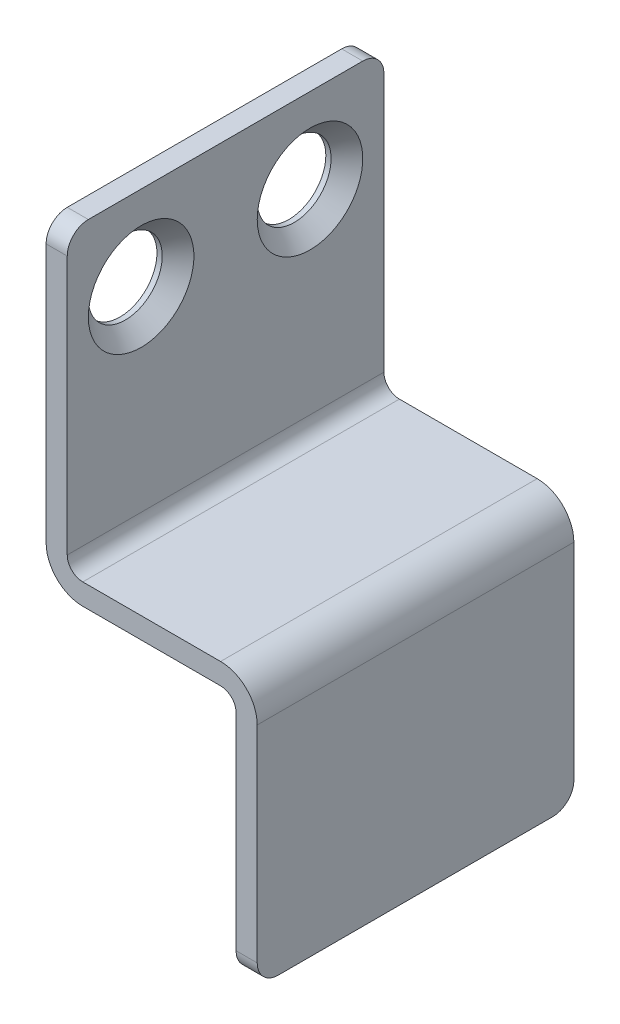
ISO-10303-21;
HEADER;
FILE_DESCRIPTION(('STEP AP214'),'2;1');
FILE_NAME('part.step','',(''),(''),'','','');
FILE_SCHEMA(('AUTOMOTIVE_DESIGN { 1 0 10303 214 1 1 1 1 }'));
ENDSEC;
DATA;
#1=APPLICATION_CONTEXT('core data for automotive mechanical design processes');
#2=APPLICATION_PROTOCOL_DEFINITION('international standard','automotive_design',2000,#1);
#3=PRODUCT_CONTEXT('',#1,'mechanical');
#4=PRODUCT('Part','Part','',(#3));
#5=PRODUCT_RELATED_PRODUCT_CATEGORY('part','',(#4));
#6=PRODUCT_DEFINITION_FORMATION('','',#4);
#7=PRODUCT_DEFINITION_CONTEXT('part definition',#1,'design');
#8=PRODUCT_DEFINITION('design','',#6,#7);
#9=PRODUCT_DEFINITION_SHAPE('','',#8);
#10=(LENGTH_UNIT() NAMED_UNIT(*) SI_UNIT(.MILLI.,.METRE.));
#11=(NAMED_UNIT(*) PLANE_ANGLE_UNIT() SI_UNIT($,.RADIAN.));
#12=(NAMED_UNIT(*) SI_UNIT($,.STERADIAN.) SOLID_ANGLE_UNIT());
#13=UNCERTAINTY_MEASURE_WITH_UNIT(LENGTH_MEASURE(1.E-05),#10,'distance_accuracy_value','');
#14=(GEOMETRIC_REPRESENTATION_CONTEXT(3) GLOBAL_UNCERTAINTY_ASSIGNED_CONTEXT((#13)) GLOBAL_UNIT_ASSIGNED_CONTEXT((#10,
#11,#12)) REPRESENTATION_CONTEXT('',''));
#15=CARTESIAN_POINT('',(0.,0.,0.));
#16=DIRECTION('',(0.,0.,1.));
#17=DIRECTION('',(1.,0.,0.));
#18=AXIS2_PLACEMENT_3D('',#15,#16,#17);
#19=CARTESIAN_POINT('',(32.,34.,146.7));
#20=DIRECTION('',(1.,0.,0.));
#21=DIRECTION('',(0.,0.,1.));
#22=AXIS2_PLACEMENT_3D('',#19,#20,#21);
#23=CONICAL_SURFACE('',#22,2.5,0.785398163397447);
#24=CARTESIAN_POINT('',(32.,34.,146.7));
#25=DIRECTION('',(1.,0.,0.));
#26=DIRECTION('',(0.,0.,1.));
#27=AXIS2_PLACEMENT_3D('',#24,#25,#26);
#28=CIRCLE('',#27,2.5);
#29=CARTESIAN_POINT('',(32.,34.,149.2));
#30=VERTEX_POINT('',#29);
#31=EDGE_CURVE('E11',#30,#30,#28,.T.);
#32=ORIENTED_EDGE('',*,*,#31,.T.);
#33=EDGE_LOOP('',(#32));
#34=FACE_BOUND('',#33,.T.);
#35=CARTESIAN_POINT('',(31.25,34.,146.7));
#36=DIRECTION('',(1.,0.,0.));
#37=DIRECTION('',(0.,0.,1.));
#38=AXIS2_PLACEMENT_3D('',#35,#36,#37);
#39=CIRCLE('',#38,1.75);
#40=CARTESIAN_POINT('',(31.25,34.,148.45));
#41=VERTEX_POINT('',#40);
#42=EDGE_CURVE('E270',#41,#41,#39,.T.);
#43=ORIENTED_EDGE('',*,*,#42,.F.);
#44=EDGE_LOOP('',(#43));
#45=FACE_BOUND('',#44,.T.);
#46=ADVANCED_FACE('F16',(#34,#45),#23,.F.);
#47=CARTESIAN_POINT('',(32.,34.,146.7));
#48=DIRECTION('',(1.,0.,0.));
#49=DIRECTION('',(0.,0.,1.));
#50=AXIS2_PLACEMENT_3D('',#47,#48,#49);
#51=CYLINDRICAL_SURFACE('',#50,1.75);
#52=ORIENTED_EDGE('',*,*,#42,.T.);
#53=EDGE_LOOP('',(#52));
#54=FACE_BOUND('',#53,.T.);
#55=CARTESIAN_POINT('',(31.,34.,146.7));
#56=DIRECTION('',(-1.,0.,0.));
#57=DIRECTION('',(0.,0.,-1.));
#58=AXIS2_PLACEMENT_3D('',#55,#56,#57);
#59=CIRCLE('',#58,1.75);
#60=CARTESIAN_POINT('',(31.,34.,144.95));
#61=VERTEX_POINT('',#60);
#62=EDGE_CURVE('E26',#61,#61,#59,.T.);
#63=ORIENTED_EDGE('',*,*,#62,.T.);
#64=EDGE_LOOP('',(#63));
#65=FACE_BOUND('',#64,.T.);
#66=ADVANCED_FACE('F278',(#54,#65),#51,.F.);
#67=CARTESIAN_POINT('',(32.,34.,154.7));
#68=DIRECTION('',(1.,0.,0.));
#69=DIRECTION('',(0.,0.,1.));
#70=AXIS2_PLACEMENT_3D('',#67,#68,#69);
#71=CONICAL_SURFACE('',#70,2.5,0.785398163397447);
#72=CARTESIAN_POINT('',(32.,34.,154.7));
#73=DIRECTION('',(1.,0.,0.));
#74=DIRECTION('',(0.,0.,1.));
#75=AXIS2_PLACEMENT_3D('',#72,#73,#74);
#76=CIRCLE('',#75,2.5);
#77=CARTESIAN_POINT('',(32.,34.,157.2));
#78=VERTEX_POINT('',#77);
#79=EDGE_CURVE('E267',#78,#78,#76,.T.);
#80=ORIENTED_EDGE('',*,*,#79,.T.);
#81=EDGE_LOOP('',(#80));
#82=FACE_BOUND('',#81,.T.);
#83=CARTESIAN_POINT('',(31.25,34.,154.7));
#84=DIRECTION('',(1.,0.,0.));
#85=DIRECTION('',(0.,0.,1.));
#86=AXIS2_PLACEMENT_3D('',#83,#84,#85);
#87=CIRCLE('',#86,1.75);
#88=CARTESIAN_POINT('',(31.25,34.,156.45));
#89=VERTEX_POINT('',#88);
#90=EDGE_CURVE('E262',#89,#89,#87,.T.);
#91=ORIENTED_EDGE('',*,*,#90,.F.);
#92=EDGE_LOOP('',(#91));
#93=FACE_BOUND('',#92,.T.);
#94=ADVANCED_FACE('F290',(#82,#93),#71,.F.);
#95=CARTESIAN_POINT('',(32.,34.,154.7));
#96=DIRECTION('',(1.,0.,0.));
#97=DIRECTION('',(0.,0.,1.));
#98=AXIS2_PLACEMENT_3D('',#95,#96,#97);
#99=CYLINDRICAL_SURFACE('',#98,1.75);
#100=ORIENTED_EDGE('',*,*,#90,.T.);
#101=EDGE_LOOP('',(#100));
#102=FACE_BOUND('',#101,.T.);
#103=CARTESIAN_POINT('',(31.,34.,154.7));
#104=DIRECTION('',(-1.,0.,0.));
#105=DIRECTION('',(0.,0.,-1.));
#106=AXIS2_PLACEMENT_3D('',#103,#104,#105);
#107=CIRCLE('',#106,1.75);
#108=CARTESIAN_POINT('',(31.,34.,152.95));
#109=VERTEX_POINT('',#108);
#110=EDGE_CURVE('E264',#109,#109,#107,.T.);
#111=ORIENTED_EDGE('',*,*,#110,.T.);
#112=EDGE_LOOP('',(#111));
#113=FACE_BOUND('',#112,.T.);
#114=ADVANCED_FACE('F295',(#102,#113),#99,.F.);
#115=CARTESIAN_POINT('',(31.,24.7366,158.2));
#116=DIRECTION('',(0.,0.,1.));
#117=DIRECTION('',(-1.,0.,0.));
#118=AXIS2_PLACEMENT_3D('',#115,#116,#117);
#119=PLANE('',#118);
#120=CARTESIAN_POINT('',(32.7366,24.7366,158.2));
#121=DIRECTION('',(0.,0.,-1.));
#122=DIRECTION('',(-1.,0.,0.));
#123=AXIS2_PLACEMENT_3D('',#120,#121,#122);
#124=CIRCLE('',#123,0.736599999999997);
#125=CARTESIAN_POINT('',(32.7366,24.,158.2));
#126=VERTEX_POINT('',#125);
#127=CARTESIAN_POINT('',(32.,24.7366,158.2));
#128=VERTEX_POINT('',#127);
#129=EDGE_CURVE('E260',#126,#128,#124,.T.);
#130=ORIENTED_EDGE('',*,*,#129,.T.);
#131=DIRECTION('',(0.,1.,0.));
#132=VECTOR('',#131,1.);
#133=CARTESIAN_POINT('',(32.,23.,158.2));
#134=LINE('',#133,#132);
#135=CARTESIAN_POINT('',(32.,37.,158.2));
#136=VERTEX_POINT('',#135);
#137=EDGE_CURVE('E257',#128,#136,#134,.T.);
#138=ORIENTED_EDGE('',*,*,#137,.T.);
#139=DIRECTION('',(-1.,0.,0.));
#140=VECTOR('',#139,1.);
#141=CARTESIAN_POINT('',(32.7366,37.,158.2));
#142=LINE('',#141,#140);
#143=CARTESIAN_POINT('',(31.,37.,158.2));
#144=VERTEX_POINT('',#143);
#145=EDGE_CURVE('E253',#136,#144,#142,.T.);
#146=ORIENTED_EDGE('',*,*,#145,.T.);
#147=DIRECTION('',(0.,1.,0.));
#148=VECTOR('',#147,1.);
#149=CARTESIAN_POINT('',(31.,23.,158.2));
#150=LINE('',#149,#148);
#151=CARTESIAN_POINT('',(31.,24.7366,158.2));
#152=VERTEX_POINT('',#151);
#153=EDGE_CURVE('E207',#152,#144,#150,.T.);
#154=ORIENTED_EDGE('',*,*,#153,.F.);
#155=CARTESIAN_POINT('',(32.7366,24.7366,158.2));
#156=DIRECTION('',(0.,0.,-1.));
#157=DIRECTION('',(1.,0.,0.));
#158=AXIS2_PLACEMENT_3D('',#155,#156,#157);
#159=CIRCLE('',#158,1.7366);
#160=CARTESIAN_POINT('',(32.7366,23.,158.2));
#161=VERTEX_POINT('',#160);
#162=EDGE_CURVE('E35',#161,#152,#159,.T.);
#163=ORIENTED_EDGE('',*,*,#162,.F.);
#164=DIRECTION('',(-1.,0.,0.));
#165=VECTOR('',#164,1.);
#166=CARTESIAN_POINT('',(40.,23.,158.2));
#167=LINE('',#166,#165);
#168=CARTESIAN_POINT('',(39.2634,23.,158.2));
#169=VERTEX_POINT('',#168);
#170=EDGE_CURVE('E196',#169,#161,#167,.T.);
#171=ORIENTED_EDGE('',*,*,#170,.F.);
#172=CARTESIAN_POINT('',(39.2634,22.2634,158.2));
#173=DIRECTION('',(0.,0.,1.));
#174=DIRECTION('',(-1.,0.,0.));
#175=AXIS2_PLACEMENT_3D('',#172,#173,#174);
#176=CIRCLE('',#175,0.736599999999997);
#177=CARTESIAN_POINT('',(40.,22.2634,158.2));
#178=VERTEX_POINT('',#177);
#179=EDGE_CURVE('E192',#178,#169,#176,.T.);
#180=ORIENTED_EDGE('',*,*,#179,.F.);
#181=DIRECTION('',(0.,1.,0.));
#182=VECTOR('',#181,1.);
#183=CARTESIAN_POINT('',(40.,23.,158.2));
#184=LINE('',#183,#182);
#185=CARTESIAN_POINT('',(40.,12.5,158.2));
#186=VERTEX_POINT('',#185);
#187=EDGE_CURVE('E159',#186,#178,#184,.T.);
#188=ORIENTED_EDGE('',*,*,#187,.F.);
#189=DIRECTION('',(1.,0.,0.));
#190=VECTOR('',#189,1.);
#191=CARTESIAN_POINT('',(41.,12.5,158.2));
#192=LINE('',#191,#190);
#193=CARTESIAN_POINT('',(41.,12.5,158.2));
#194=VERTEX_POINT('',#193);
#195=EDGE_CURVE('E143',#186,#194,#192,.T.);
#196=ORIENTED_EDGE('',*,*,#195,.T.);
#197=DIRECTION('',(0.,1.,0.));
#198=VECTOR('',#197,1.);
#199=CARTESIAN_POINT('',(41.,23.,158.2));
#200=LINE('',#199,#198);
#201=CARTESIAN_POINT('',(41.,22.2634,158.2));
#202=VERTEX_POINT('',#201);
#203=EDGE_CURVE('E132',#194,#202,#200,.T.);
#204=ORIENTED_EDGE('',*,*,#203,.T.);
#205=CARTESIAN_POINT('',(39.2634,22.2634,158.2));
#206=DIRECTION('',(0.,0.,1.));
#207=DIRECTION('',(-1.,0.,0.));
#208=AXIS2_PLACEMENT_3D('',#205,#206,#207);
#209=CIRCLE('',#208,1.7366);
#210=CARTESIAN_POINT('',(39.2634,24.,158.2));
#211=VERTEX_POINT('',#210);
#212=EDGE_CURVE('E241',#202,#211,#209,.T.);
#213=ORIENTED_EDGE('',*,*,#212,.T.);
#214=DIRECTION('',(-1.,0.,0.));
#215=VECTOR('',#214,1.);
#216=CARTESIAN_POINT('',(40.,24.,158.2));
#217=LINE('',#216,#215);
#218=EDGE_CURVE('E239',#211,#126,#217,.T.);
#219=ORIENTED_EDGE('',*,*,#218,.T.);
#220=EDGE_LOOP('',(#130,#138,#146,#154,#163,#171,#180,#188,#196,#204,#213,#219));
#221=FACE_BOUND('',#220,.T.);
#222=ADVANCED_FACE('F156',(#221),#119,.T.);
#223=CARTESIAN_POINT('',(32.7366,23.,143.2));
#224=DIRECTION('',(0.,0.,-1.));
#225=DIRECTION('',(1.,0.,0.));
#226=AXIS2_PLACEMENT_3D('',#223,#224,#225);
#227=PLANE('',#226);
#228=CARTESIAN_POINT('',(32.7366,24.7366,143.2));
#229=DIRECTION('',(0.,0.,-1.));
#230=DIRECTION('',(-1.,0.,0.));
#231=AXIS2_PLACEMENT_3D('',#228,#229,#230);
#232=CIRCLE('',#231,0.736599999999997);
#233=CARTESIAN_POINT('',(32.7366,24.,143.2));
#234=VERTEX_POINT('',#233);
#235=CARTESIAN_POINT('',(32.,24.7366,143.2));
#236=VERTEX_POINT('',#235);
#237=EDGE_CURVE('E163',#234,#236,#232,.T.);
#238=ORIENTED_EDGE('',*,*,#237,.F.);
#239=DIRECTION('',(-1.,0.,0.));
#240=VECTOR('',#239,1.);
#241=CARTESIAN_POINT('',(40.,24.,143.2));
#242=LINE('',#241,#240);
#243=CARTESIAN_POINT('',(39.2634,24.,143.2));
#244=VERTEX_POINT('',#243);
#245=EDGE_CURVE('E169',#244,#234,#242,.T.);
#246=ORIENTED_EDGE('',*,*,#245,.F.);
#247=CARTESIAN_POINT('',(39.2634,22.2634,143.2));
#248=DIRECTION('',(0.,0.,1.));
#249=DIRECTION('',(-1.,0.,0.));
#250=AXIS2_PLACEMENT_3D('',#247,#248,#249);
#251=CIRCLE('',#250,1.7366);
#252=CARTESIAN_POINT('',(41.,22.2634,143.2));
#253=VERTEX_POINT('',#252);
#254=EDGE_CURVE('E171',#253,#244,#251,.T.);
#255=ORIENTED_EDGE('',*,*,#254,.F.);
#256=DIRECTION('',(0.,1.,0.));
#257=VECTOR('',#256,1.);
#258=CARTESIAN_POINT('',(41.,23.,143.2));
#259=LINE('',#258,#257);
#260=CARTESIAN_POINT('',(41.,12.5,143.2));
#261=VERTEX_POINT('',#260);
#262=EDGE_CURVE('E173',#261,#253,#259,.T.);
#263=ORIENTED_EDGE('',*,*,#262,.F.);
#264=DIRECTION('',(-1.,0.,0.));
#265=VECTOR('',#264,1.);
#266=CARTESIAN_POINT('',(39.2634,12.5,143.2));
#267=LINE('',#266,#265);
#268=CARTESIAN_POINT('',(40.,12.5,143.2));
#269=VERTEX_POINT('',#268);
#270=EDGE_CURVE('E231',#261,#269,#267,.T.);
#271=ORIENTED_EDGE('',*,*,#270,.T.);
#272=DIRECTION('',(0.,1.,0.));
#273=VECTOR('',#272,1.);
#274=CARTESIAN_POINT('',(40.,23.,143.2));
#275=LINE('',#274,#273);
#276=CARTESIAN_POINT('',(40.,22.2634,143.2));
#277=VERTEX_POINT('',#276);
#278=EDGE_CURVE('E228',#269,#277,#275,.T.);
#279=ORIENTED_EDGE('',*,*,#278,.T.);
#280=CARTESIAN_POINT('',(39.2634,22.2634,143.2));
#281=DIRECTION('',(0.,0.,1.));
#282=DIRECTION('',(-1.,0.,0.));
#283=AXIS2_PLACEMENT_3D('',#280,#281,#282);
#284=CIRCLE('',#283,0.736599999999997);
#285=CARTESIAN_POINT('',(39.2634,23.,143.2));
#286=VERTEX_POINT('',#285);
#287=EDGE_CURVE('E234',#277,#286,#284,.T.);
#288=ORIENTED_EDGE('',*,*,#287,.T.);
#289=DIRECTION('',(-1.,0.,0.));
#290=VECTOR('',#289,1.);
#291=CARTESIAN_POINT('',(40.,23.,143.2));
#292=LINE('',#291,#290);
#293=CARTESIAN_POINT('',(32.7366,23.,143.2));
#294=VERTEX_POINT('',#293);
#295=EDGE_CURVE('E244',#286,#294,#292,.T.);
#296=ORIENTED_EDGE('',*,*,#295,.T.);
#297=CARTESIAN_POINT('',(32.7366,24.7366,143.2));
#298=DIRECTION('',(0.,0.,-1.));
#299=DIRECTION('',(1.,0.,0.));
#300=AXIS2_PLACEMENT_3D('',#297,#298,#299);
#301=CIRCLE('',#300,1.7366);
#302=CARTESIAN_POINT('',(31.,24.7366,143.2));
#303=VERTEX_POINT('',#302);
#304=EDGE_CURVE('E249',#294,#303,#301,.T.);
#305=ORIENTED_EDGE('',*,*,#304,.T.);
#306=DIRECTION('',(0.,1.,0.));
#307=VECTOR('',#306,1.);
#308=CARTESIAN_POINT('',(31.,23.,143.2));
#309=LINE('',#308,#307);
#310=CARTESIAN_POINT('',(31.,37.,143.2));
#311=VERTEX_POINT('',#310);
#312=EDGE_CURVE('E144',#303,#311,#309,.T.);
#313=ORIENTED_EDGE('',*,*,#312,.T.);
#314=DIRECTION('',(1.,0.,0.));
#315=VECTOR('',#314,1.);
#316=CARTESIAN_POINT('',(32.7366,37.,143.2));
#317=LINE('',#316,#315);
#318=CARTESIAN_POINT('',(32.,37.,143.2));
#319=VERTEX_POINT('',#318);
#320=EDGE_CURVE('E20',#311,#319,#317,.T.);
#321=ORIENTED_EDGE('',*,*,#320,.T.);
#322=DIRECTION('',(0.,1.,0.));
#323=VECTOR('',#322,1.);
#324=CARTESIAN_POINT('',(32.,23.,143.2));
#325=LINE('',#324,#323);
#326=EDGE_CURVE('E219',#236,#319,#325,.T.);
#327=ORIENTED_EDGE('',*,*,#326,.F.);
#328=EDGE_LOOP('',(#238,#246,#255,#263,#271,#279,#288,#296,#305,#313,#321,#327));
#329=FACE_BOUND('',#328,.T.);
#330=ADVANCED_FACE('F302',(#329),#227,.T.);
#331=CARTESIAN_POINT('',(32.,23.,158.2));
#332=DIRECTION('',(-1.,0.,0.));
#333=DIRECTION('',(0.,0.,-1.));
#334=AXIS2_PLACEMENT_3D('',#331,#332,#333);
#335=PLANE('',#334);
#336=ORIENTED_EDGE('',*,*,#31,.F.);
#337=EDGE_LOOP('',(#336));
#338=FACE_BOUND('',#337,.T.);
#339=ORIENTED_EDGE('',*,*,#79,.F.);
#340=EDGE_LOOP('',(#339));
#341=FACE_BOUND('',#340,.T.);
#342=DIRECTION('',(0.,0.,-1.));
#343=VECTOR('',#342,1.);
#344=CARTESIAN_POINT('',(32.,38.,158.2));
#345=LINE('',#344,#343);
#346=CARTESIAN_POINT('',(32.,38.,157.2));
#347=VERTEX_POINT('',#346);
#348=CARTESIAN_POINT('',(32.,38.,144.2));
#349=VERTEX_POINT('',#348);
#350=EDGE_CURVE('E211',#347,#349,#345,.T.);
#351=ORIENTED_EDGE('',*,*,#350,.F.);
#352=CARTESIAN_POINT('',(32.,37.,157.2));
#353=DIRECTION('',(1.,0.,0.));
#354=DIRECTION('',(0.,0.,-1.));
#355=AXIS2_PLACEMENT_3D('',#352,#353,#354);
#356=CIRCLE('',#355,1.);
#357=EDGE_CURVE('E225',#347,#136,#356,.T.);
#358=ORIENTED_EDGE('',*,*,#357,.T.);
#359=ORIENTED_EDGE('',*,*,#137,.F.);
#360=DIRECTION('',(0.,0.,-1.));
#361=VECTOR('',#360,1.);
#362=CARTESIAN_POINT('',(32.,24.7366,158.2));
#363=LINE('',#362,#361);
#364=EDGE_CURVE('E222',#128,#236,#363,.T.);
#365=ORIENTED_EDGE('',*,*,#364,.T.);
#366=ORIENTED_EDGE('',*,*,#326,.T.);
#367=CARTESIAN_POINT('',(32.,37.,144.2));
#368=DIRECTION('',(1.,0.,0.));
#369=DIRECTION('',(0.,0.,-1.));
#370=AXIS2_PLACEMENT_3D('',#367,#368,#369);
#371=CIRCLE('',#370,1.);
#372=EDGE_CURVE('E215',#319,#349,#371,.T.);
#373=ORIENTED_EDGE('',*,*,#372,.T.);
#374=EDGE_LOOP('',(#351,#358,#359,#365,#366,#373));
#375=FACE_BOUND('',#374,.T.);
#376=ADVANCED_FACE('F305',(#338,#341,#375),#335,.F.);
#377=CARTESIAN_POINT('',(31.,38.,158.2));
#378=DIRECTION('',(0.,1.,0.));
#379=DIRECTION('',(0.,0.,-1.));
#380=AXIS2_PLACEMENT_3D('',#377,#378,#379);
#381=PLANE('',#380);
#382=DIRECTION('',(0.,0.,-1.));
#383=VECTOR('',#382,1.);
#384=CARTESIAN_POINT('',(31.,38.,158.2));
#385=LINE('',#384,#383);
#386=CARTESIAN_POINT('',(31.,38.,157.2));
#387=VERTEX_POINT('',#386);
#388=CARTESIAN_POINT('',(31.,38.,144.2));
#389=VERTEX_POINT('',#388);
#390=EDGE_CURVE('E203',#387,#389,#385,.T.);
#391=ORIENTED_EDGE('',*,*,#390,.F.);
#392=DIRECTION('',(1.,0.,0.));
#393=VECTOR('',#392,1.);
#394=CARTESIAN_POINT('',(31.,38.,157.2));
#395=LINE('',#394,#393);
#396=EDGE_CURVE('E212',#387,#347,#395,.T.);
#397=ORIENTED_EDGE('',*,*,#396,.T.);
#398=ORIENTED_EDGE('',*,*,#350,.T.);
#399=DIRECTION('',(-1.,0.,0.));
#400=VECTOR('',#399,1.);
#401=CARTESIAN_POINT('',(31.,38.,144.2));
#402=LINE('',#401,#400);
#403=EDGE_CURVE('E208',#349,#389,#402,.T.);
#404=ORIENTED_EDGE('',*,*,#403,.T.);
#405=EDGE_LOOP('',(#391,#397,#398,#404));
#406=FACE_BOUND('',#405,.T.);
#407=ADVANCED_FACE('F309',(#406),#381,.T.);
#408=CARTESIAN_POINT('',(31.,23.,158.2));
#409=DIRECTION('',(-1.,0.,0.));
#410=DIRECTION('',(0.,0.,-1.));
#411=AXIS2_PLACEMENT_3D('',#408,#409,#410);
#412=PLANE('',#411);
#413=ORIENTED_EDGE('',*,*,#62,.F.);
#414=EDGE_LOOP('',(#413));
#415=FACE_BOUND('',#414,.T.);
#416=ORIENTED_EDGE('',*,*,#110,.F.);
#417=EDGE_LOOP('',(#416));
#418=FACE_BOUND('',#417,.T.);
#419=ORIENTED_EDGE('',*,*,#153,.T.);
#420=CARTESIAN_POINT('',(31.,37.,157.2));
#421=DIRECTION('',(-1.,0.,0.));
#422=DIRECTION('',(0.,0.,-1.));
#423=AXIS2_PLACEMENT_3D('',#420,#421,#422);
#424=CIRCLE('',#423,1.);
#425=EDGE_CURVE('E204',#144,#387,#424,.T.);
#426=ORIENTED_EDGE('',*,*,#425,.T.);
#427=ORIENTED_EDGE('',*,*,#390,.T.);
#428=CARTESIAN_POINT('',(31.,37.,144.2));
#429=DIRECTION('',(-1.,0.,0.));
#430=DIRECTION('',(0.,0.,-1.));
#431=AXIS2_PLACEMENT_3D('',#428,#429,#430);
#432=CIRCLE('',#431,1.);
#433=EDGE_CURVE('E200',#389,#311,#432,.T.);
#434=ORIENTED_EDGE('',*,*,#433,.T.);
#435=ORIENTED_EDGE('',*,*,#312,.F.);
#436=DIRECTION('',(0.,0.,-1.));
#437=VECTOR('',#436,1.);
#438=CARTESIAN_POINT('',(31.,24.7366,158.2));
#439=LINE('',#438,#437);
#440=EDGE_CURVE('E197',#152,#303,#439,.T.);
#441=ORIENTED_EDGE('',*,*,#440,.F.);
#442=EDGE_LOOP('',(#419,#426,#427,#434,#435,#441));
#443=FACE_BOUND('',#442,.T.);
#444=ADVANCED_FACE('F313',(#415,#418,#443),#412,.T.);
#445=CARTESIAN_POINT('',(32.7366,24.7366,158.2));
#446=DIRECTION('',(0.,0.,-1.));
#447=DIRECTION('',(1.,0.,0.));
#448=AXIS2_PLACEMENT_3D('',#445,#446,#447);
#449=CYLINDRICAL_SURFACE('',#448,1.7366);
#450=ORIENTED_EDGE('',*,*,#304,.F.);
#451=DIRECTION('',(0.,0.,-1.));
#452=VECTOR('',#451,1.);
#453=CARTESIAN_POINT('',(32.7366,23.,158.2));
#454=LINE('',#453,#452);
#455=EDGE_CURVE('E193',#161,#294,#454,.T.);
#456=ORIENTED_EDGE('',*,*,#455,.F.);
#457=ORIENTED_EDGE('',*,*,#162,.T.);
#458=ORIENTED_EDGE('',*,*,#440,.T.);
#459=EDGE_LOOP('',(#450,#456,#457,#458));
#460=FACE_BOUND('',#459,.T.);
#461=ADVANCED_FACE('F317',(#460),#449,.T.);
#462=CARTESIAN_POINT('',(40.,23.,158.2));
#463=DIRECTION('',(0.,-1.,0.));
#464=DIRECTION('',(0.,0.,1.));
#465=AXIS2_PLACEMENT_3D('',#462,#463,#464);
#466=PLANE('',#465);
#467=ORIENTED_EDGE('',*,*,#295,.F.);
#468=DIRECTION('',(0.,0.,-1.));
#469=VECTOR('',#468,1.);
#470=CARTESIAN_POINT('',(39.2634,23.,158.2));
#471=LINE('',#470,#469);
#472=EDGE_CURVE('E186',#169,#286,#471,.T.);
#473=ORIENTED_EDGE('',*,*,#472,.F.);
#474=ORIENTED_EDGE('',*,*,#170,.T.);
#475=ORIENTED_EDGE('',*,*,#455,.T.);
#476=EDGE_LOOP('',(#467,#473,#474,#475));
#477=FACE_BOUND('',#476,.T.);
#478=ADVANCED_FACE('F321',(#477),#466,.T.);
#479=CARTESIAN_POINT('',(39.2634,22.2634,158.2));
#480=DIRECTION('',(0.,0.,-1.));
#481=DIRECTION('',(1.,0.,0.));
#482=AXIS2_PLACEMENT_3D('',#479,#480,#481);
#483=CYLINDRICAL_SURFACE('',#482,0.736599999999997);
#484=ORIENTED_EDGE('',*,*,#287,.F.);
#485=DIRECTION('',(0.,0.,-1.));
#486=VECTOR('',#485,1.);
#487=CARTESIAN_POINT('',(40.,22.2634,158.2));
#488=LINE('',#487,#486);
#489=EDGE_CURVE('E182',#178,#277,#488,.T.);
#490=ORIENTED_EDGE('',*,*,#489,.F.);
#491=ORIENTED_EDGE('',*,*,#179,.T.);
#492=ORIENTED_EDGE('',*,*,#472,.T.);
#493=EDGE_LOOP('',(#484,#490,#491,#492));
#494=FACE_BOUND('',#493,.T.);
#495=ADVANCED_FACE('F324',(#494),#483,.F.);
#496=CARTESIAN_POINT('',(40.,23.,158.2));
#497=DIRECTION('',(-1.,0.,0.));
#498=DIRECTION('',(0.,0.,-1.));
#499=AXIS2_PLACEMENT_3D('',#496,#497,#498);
#500=PLANE('',#499);
#501=DIRECTION('',(0.,0.,-1.));
#502=VECTOR('',#501,1.);
#503=CARTESIAN_POINT('',(40.,11.5,158.2));
#504=LINE('',#503,#502);
#505=CARTESIAN_POINT('',(40.,11.5,157.2));
#506=VERTEX_POINT('',#505);
#507=CARTESIAN_POINT('',(40.,11.5,144.2));
#508=VERTEX_POINT('',#507);
#509=EDGE_CURVE('E176',#506,#508,#504,.T.);
#510=ORIENTED_EDGE('',*,*,#509,.F.);
#511=CARTESIAN_POINT('',(40.,12.5,157.2));
#512=DIRECTION('',(-1.,0.,0.));
#513=DIRECTION('',(0.,0.,-1.));
#514=AXIS2_PLACEMENT_3D('',#511,#512,#513);
#515=CIRCLE('',#514,1.);
#516=EDGE_CURVE('E184',#506,#186,#515,.T.);
#517=ORIENTED_EDGE('',*,*,#516,.T.);
#518=ORIENTED_EDGE('',*,*,#187,.T.);
#519=ORIENTED_EDGE('',*,*,#489,.T.);
#520=ORIENTED_EDGE('',*,*,#278,.F.);
#521=CARTESIAN_POINT('',(40.,12.5,144.2));
#522=DIRECTION('',(-1.,0.,0.));
#523=DIRECTION('',(0.,0.,-1.));
#524=AXIS2_PLACEMENT_3D('',#521,#522,#523);
#525=CIRCLE('',#524,1.);
#526=EDGE_CURVE('E178',#269,#508,#525,.T.);
#527=ORIENTED_EDGE('',*,*,#526,.T.);
#528=EDGE_LOOP('',(#510,#517,#518,#519,#520,#527));
#529=FACE_BOUND('',#528,.T.);
#530=ADVANCED_FACE('F328',(#529),#500,.T.);
#531=CARTESIAN_POINT('',(41.,11.5,158.2));
#532=DIRECTION('',(0.,-1.,0.));
#533=DIRECTION('',(0.,0.,1.));
#534=AXIS2_PLACEMENT_3D('',#531,#532,#533);
#535=PLANE('',#534);
#536=DIRECTION('',(0.,0.,-1.));
#537=VECTOR('',#536,1.);
#538=CARTESIAN_POINT('',(41.,11.5,158.2));
#539=LINE('',#538,#537);
#540=CARTESIAN_POINT('',(41.,11.5,157.2));
#541=VERTEX_POINT('',#540);
#542=CARTESIAN_POINT('',(41.,11.5,144.2));
#543=VERTEX_POINT('',#542);
#544=EDGE_CURVE('E128',#541,#543,#539,.T.);
#545=ORIENTED_EDGE('',*,*,#544,.F.);
#546=DIRECTION('',(-1.,0.,0.));
#547=VECTOR('',#546,1.);
#548=CARTESIAN_POINT('',(40.,11.5,157.2));
#549=LINE('',#548,#547);
#550=EDGE_CURVE('E152',#541,#506,#549,.T.);
#551=ORIENTED_EDGE('',*,*,#550,.T.);
#552=ORIENTED_EDGE('',*,*,#509,.T.);
#553=DIRECTION('',(1.,0.,0.));
#554=VECTOR('',#553,1.);
#555=CARTESIAN_POINT('',(41.,11.5,144.2));
#556=LINE('',#555,#554);
#557=EDGE_CURVE('E153',#508,#543,#556,.T.);
#558=ORIENTED_EDGE('',*,*,#557,.T.);
#559=EDGE_LOOP('',(#545,#551,#552,#558));
#560=FACE_BOUND('',#559,.T.);
#561=ADVANCED_FACE('F332',(#560),#535,.T.);
#562=CARTESIAN_POINT('',(41.,23.,158.2));
#563=DIRECTION('',(-1.,0.,0.));
#564=DIRECTION('',(0.,0.,-1.));
#565=AXIS2_PLACEMENT_3D('',#562,#563,#564);
#566=PLANE('',#565);
#567=ORIENTED_EDGE('',*,*,#203,.F.);
#568=CARTESIAN_POINT('',(41.,12.5,157.2));
#569=DIRECTION('',(1.,0.,0.));
#570=DIRECTION('',(0.,0.,-1.));
#571=AXIS2_PLACEMENT_3D('',#568,#569,#570);
#572=CIRCLE('',#571,1.);
#573=EDGE_CURVE('E135',#194,#541,#572,.T.);
#574=ORIENTED_EDGE('',*,*,#573,.T.);
#575=ORIENTED_EDGE('',*,*,#544,.T.);
#576=CARTESIAN_POINT('',(41.,12.5,144.2));
#577=DIRECTION('',(1.,0.,0.));
#578=DIRECTION('',(0.,0.,-1.));
#579=AXIS2_PLACEMENT_3D('',#576,#577,#578);
#580=CIRCLE('',#579,1.);
#581=EDGE_CURVE('E172',#543,#261,#580,.T.);
#582=ORIENTED_EDGE('',*,*,#581,.T.);
#583=ORIENTED_EDGE('',*,*,#262,.T.);
#584=DIRECTION('',(0.,0.,-1.));
#585=VECTOR('',#584,1.);
#586=CARTESIAN_POINT('',(41.,22.2634,158.2));
#587=LINE('',#586,#585);
#588=EDGE_CURVE('E138',#202,#253,#587,.T.);
#589=ORIENTED_EDGE('',*,*,#588,.F.);
#590=EDGE_LOOP('',(#567,#574,#575,#582,#583,#589));
#591=FACE_BOUND('',#590,.T.);
#592=ADVANCED_FACE('F134',(#591),#566,.F.);
#593=CARTESIAN_POINT('',(39.2634,22.2634,158.2));
#594=DIRECTION('',(0.,0.,-1.));
#595=DIRECTION('',(1.,0.,0.));
#596=AXIS2_PLACEMENT_3D('',#593,#594,#595);
#597=CYLINDRICAL_SURFACE('',#596,1.7366);
#598=ORIENTED_EDGE('',*,*,#254,.T.);
#599=DIRECTION('',(0.,0.,-1.));
#600=VECTOR('',#599,1.);
#601=CARTESIAN_POINT('',(39.2634,24.,158.2));
#602=LINE('',#601,#600);
#603=EDGE_CURVE('E166',#211,#244,#602,.T.);
#604=ORIENTED_EDGE('',*,*,#603,.F.);
#605=ORIENTED_EDGE('',*,*,#212,.F.);
#606=ORIENTED_EDGE('',*,*,#588,.T.);
#607=EDGE_LOOP('',(#598,#604,#605,#606));
#608=FACE_BOUND('',#607,.T.);
#609=ADVANCED_FACE('F339',(#608),#597,.T.);
#610=CARTESIAN_POINT('',(40.,24.,158.2));
#611=DIRECTION('',(0.,-1.,0.));
#612=DIRECTION('',(0.,0.,1.));
#613=AXIS2_PLACEMENT_3D('',#610,#611,#612);
#614=PLANE('',#613);
#615=ORIENTED_EDGE('',*,*,#245,.T.);
#616=DIRECTION('',(0.,0.,-1.));
#617=VECTOR('',#616,1.);
#618=CARTESIAN_POINT('',(32.7366,24.,158.2));
#619=LINE('',#618,#617);
#620=EDGE_CURVE('E161',#126,#234,#619,.T.);
#621=ORIENTED_EDGE('',*,*,#620,.F.);
#622=ORIENTED_EDGE('',*,*,#218,.F.);
#623=ORIENTED_EDGE('',*,*,#603,.T.);
#624=EDGE_LOOP('',(#615,#621,#622,#623));
#625=FACE_BOUND('',#624,.T.);
#626=ADVANCED_FACE('F342',(#625),#614,.F.);
#627=CARTESIAN_POINT('',(32.7366,24.7366,158.2));
#628=DIRECTION('',(0.,0.,-1.));
#629=DIRECTION('',(1.,0.,0.));
#630=AXIS2_PLACEMENT_3D('',#627,#628,#629);
#631=CYLINDRICAL_SURFACE('',#630,0.736599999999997);
#632=ORIENTED_EDGE('',*,*,#237,.T.);
#633=ORIENTED_EDGE('',*,*,#364,.F.);
#634=ORIENTED_EDGE('',*,*,#129,.F.);
#635=ORIENTED_EDGE('',*,*,#620,.T.);
#636=EDGE_LOOP('',(#632,#633,#634,#635));
#637=FACE_BOUND('',#636,.T.);
#638=ADVANCED_FACE('F346',(#637),#631,.F.);
#639=CARTESIAN_POINT('',(41.,12.5,157.2));
#640=DIRECTION('',(1.,0.,0.));
#641=DIRECTION('',(0.,0.,1.));
#642=AXIS2_PLACEMENT_3D('',#639,#640,#641);
#643=CYLINDRICAL_SURFACE('',#642,1.);
#644=ORIENTED_EDGE('',*,*,#573,.F.);
#645=ORIENTED_EDGE('',*,*,#195,.F.);
#646=ORIENTED_EDGE('',*,*,#516,.F.);
#647=ORIENTED_EDGE('',*,*,#550,.F.);
#648=EDGE_LOOP('',(#644,#645,#646,#647));
#649=FACE_BOUND('',#648,.T.);
#650=ADVANCED_FACE('F149',(#649),#643,.T.);
#651=CARTESIAN_POINT('',(39.2634,12.5,144.2));
#652=DIRECTION('',(-1.,0.,0.));
#653=DIRECTION('',(0.,0.,-1.));
#654=AXIS2_PLACEMENT_3D('',#651,#652,#653);
#655=CYLINDRICAL_SURFACE('',#654,1.);
#656=ORIENTED_EDGE('',*,*,#581,.F.);
#657=ORIENTED_EDGE('',*,*,#557,.F.);
#658=ORIENTED_EDGE('',*,*,#526,.F.);
#659=ORIENTED_EDGE('',*,*,#270,.F.);
#660=EDGE_LOOP('',(#656,#657,#658,#659));
#661=FACE_BOUND('',#660,.T.);
#662=ADVANCED_FACE('F353',(#661),#655,.T.);
#663=CARTESIAN_POINT('',(31.,37.,157.2));
#664=DIRECTION('',(1.,0.,0.));
#665=DIRECTION('',(0.,0.,1.));
#666=AXIS2_PLACEMENT_3D('',#663,#664,#665);
#667=CYLINDRICAL_SURFACE('',#666,1.);
#668=ORIENTED_EDGE('',*,*,#425,.F.);
#669=ORIENTED_EDGE('',*,*,#145,.F.);
#670=ORIENTED_EDGE('',*,*,#357,.F.);
#671=ORIENTED_EDGE('',*,*,#396,.F.);
#672=EDGE_LOOP('',(#668,#669,#670,#671));
#673=FACE_BOUND('',#672,.T.);
#674=ADVANCED_FACE('F355',(#673),#667,.T.);
#675=CARTESIAN_POINT('',(32.7366,37.,144.2));
#676=DIRECTION('',(1.,0.,0.));
#677=DIRECTION('',(0.,0.,1.));
#678=AXIS2_PLACEMENT_3D('',#675,#676,#677);
#679=CYLINDRICAL_SURFACE('',#678,1.);
#680=ORIENTED_EDGE('',*,*,#433,.F.);
#681=ORIENTED_EDGE('',*,*,#403,.F.);
#682=ORIENTED_EDGE('',*,*,#372,.F.);
#683=ORIENTED_EDGE('',*,*,#320,.F.);
#684=EDGE_LOOP('',(#680,#681,#682,#683));
#685=FACE_BOUND('',#684,.T.);
#686=ADVANCED_FACE('F18',(#685),#679,.T.);
#687=CLOSED_SHELL('',(#46,#66,#94,#114,#222,#330,#376,#407,#444,#461,#478,#495,#530,#561,#592,
#609,#626,#638,#650,#662,#674,#686));
#688=MANIFOLD_SOLID_BREP('B1',#687);
#689=ADVANCED_BREP_SHAPE_REPRESENTATION('',(#18,#688),#14);
#690=SHAPE_DEFINITION_REPRESENTATION(#9,#689);
ENDSEC;
END-ISO-10303-21;
